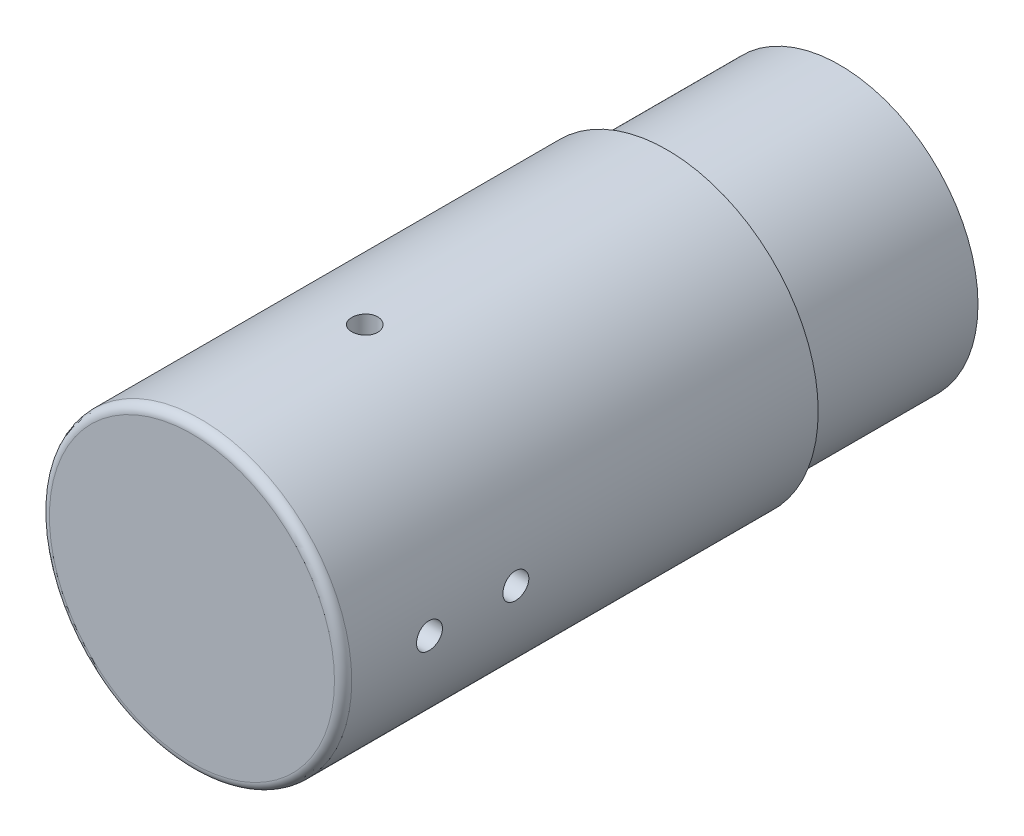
from build123d import *

# Parameters (mm, degrees)
SKIZZE1_R                       = 17.5
AUFSATZ_LINEAR_AUSTRAGEN1_DEPTH = 55
SKIZZE2_R                       = 16
AUFSATZ_LINEAR_AUSTRAGEN2_DEPTH = 20
SKIZZE5_R                       = 1.5
SCHNITT_LINEAR_AUSTRAGEN1_DEPTH = 20
KREISMUSTER2_COUNT              = 4
VERRUNDUNG1_R                   = 1
SKIZZE6_R                       = 1.5
SCHNITT_LINEAR_AUSTRAGEN2_DEPTH = 15


with BuildPart() as part:
    # Skizze1 → Aufsatz-Linear austragen1 (new body)
    with BuildSketch(Plane.XY):
        Circle(SKIZZE1_R)
    extrude(amount=-AUFSATZ_LINEAR_AUSTRAGEN1_DEPTH)

    # Skizze2 → Aufsatz-Linear austragen2 (add)
    with BuildSketch(Plane(origin=(0, 0, -55), x_dir=(-1, 0, 0), z_dir=(0, 0, -1))):
        with Locations(Location((0, 0, 0), (0, 0, 180))):
            Circle(SKIZZE2_R)
    extrude(amount=AUFSATZ_LINEAR_AUSTRAGEN2_DEPTH)

    # Skizze4 → Schnitt-Rotation1 (revolve, cut)
    with BuildSketch(Plane(origin=(0, 0, 0), x_dir=(0, 0, -1), z_dir=(1, 0, 0)), mode=Mode.PRIVATE) as schnitt_rotation1_sk:
        Polygon((5, 0), (5, -7), (43, -8.5), (45.5, -9.5), (75, -9.5), (75, 0), align=None)
    revolve(schnitt_rotation1_sk.sketch.rotate(Axis((0, 0, 0), (0, 0, -1)), 270), axis=Axis((0, 0, 0), (0, 0, -1)), mode=Mode.SUBTRACT)

    # Skizze5 → Schnitt-Linear austragen1 (cut)
    with BuildSketch(Plane(origin=(17.5, 0, 0), x_dir=(0, 0, -1), z_dir=(1, 0, 0))):
        with Locations((20, 0)):
            Circle(SKIZZE5_R)
    schnitt_linear_austragen1 = extrude(amount=-SCHNITT_LINEAR_AUSTRAGEN1_DEPTH, mode=Mode.SUBTRACT)

    # Kreismuster2: Schnitt-Linear austragen1 ×4 about axis
    kreismuster2_axis = Axis((0, 0, 0), (0, 0, 1))
    for i in range(1, KREISMUSTER2_COUNT):
        add(schnitt_linear_austragen1.rotate(kreismuster2_axis, i * 360 / KREISMUSTER2_COUNT), mode=Mode.SUBTRACT)

    # Verrundung1
    verrundung1_edges = [part.edges().sort_by_distance(p)[0] for p in [
        (-17.5, 0, 0),
    ]]
    fillet(verrundung1_edges, radius=VERRUNDUNG1_R)

    # Skizze6 → Schnitt-Linear austragen2 (cut)
    with BuildSketch(Plane(origin=(17.5, 0, 0), x_dir=(0, 0, -1), z_dir=(1, 0, 0))):
        with Locations((10, 0)):
            Circle(SKIZZE6_R)
    extrude(amount=-SCHNITT_LINEAR_AUSTRAGEN2_DEPTH, mode=Mode.SUBTRACT)


solid = part.part
